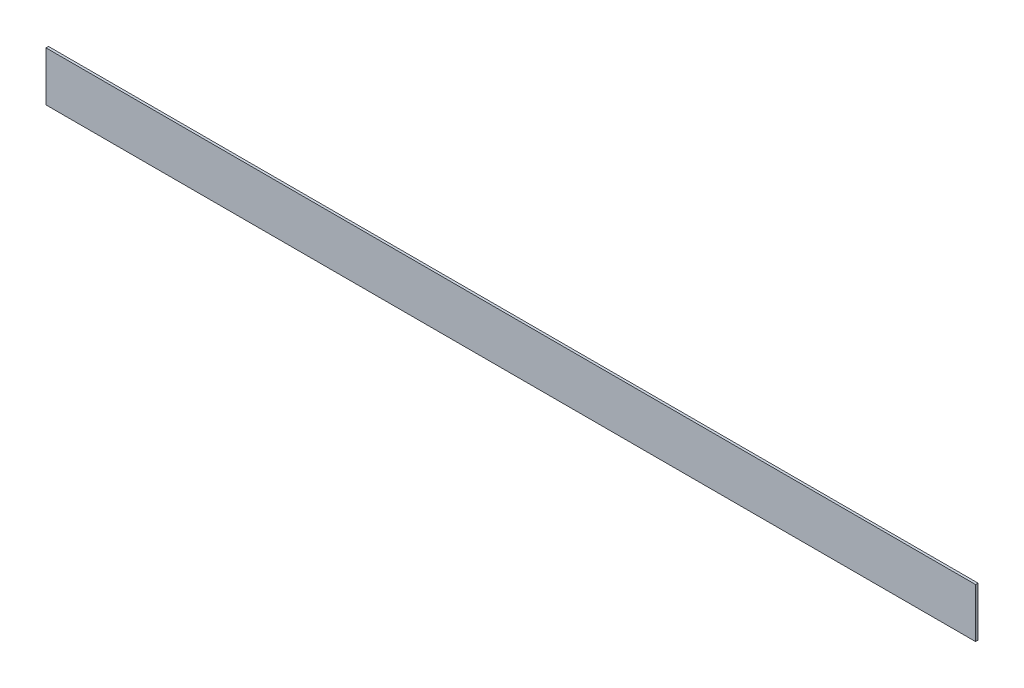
ISO-10303-21;
HEADER;
FILE_DESCRIPTION(('STEP AP214'),'2;1');
FILE_NAME('part.step','',(''),(''),'','','');
FILE_SCHEMA(('AUTOMOTIVE_DESIGN { 1 0 10303 214 1 1 1 1 }'));
ENDSEC;
DATA;
#1=APPLICATION_CONTEXT('core data for automotive mechanical design processes');
#2=APPLICATION_PROTOCOL_DEFINITION('international standard','automotive_design',2000,#1);
#3=PRODUCT_CONTEXT('',#1,'mechanical');
#4=PRODUCT('Part','Part','',(#3));
#5=PRODUCT_RELATED_PRODUCT_CATEGORY('part','',(#4));
#6=PRODUCT_DEFINITION_FORMATION('','',#4);
#7=PRODUCT_DEFINITION_CONTEXT('part definition',#1,'design');
#8=PRODUCT_DEFINITION('design','',#6,#7);
#9=PRODUCT_DEFINITION_SHAPE('','',#8);
#10=(LENGTH_UNIT() NAMED_UNIT(*) SI_UNIT(.MILLI.,.METRE.));
#11=(NAMED_UNIT(*) PLANE_ANGLE_UNIT() SI_UNIT($,.RADIAN.));
#12=(NAMED_UNIT(*) SI_UNIT($,.STERADIAN.) SOLID_ANGLE_UNIT());
#13=UNCERTAINTY_MEASURE_WITH_UNIT(LENGTH_MEASURE(1.E-05),#10,'distance_accuracy_value','');
#14=(GEOMETRIC_REPRESENTATION_CONTEXT(3) GLOBAL_UNCERTAINTY_ASSIGNED_CONTEXT((#13)) GLOBAL_UNIT_ASSIGNED_CONTEXT((#10,
#11,#12)) REPRESENTATION_CONTEXT('',''));
#15=CARTESIAN_POINT('',(0.,0.,0.));
#16=DIRECTION('',(0.,0.,1.));
#17=DIRECTION('',(1.,0.,0.));
#18=AXIS2_PLACEMENT_3D('',#15,#16,#17);
#19=CARTESIAN_POINT('',(0.,0.,6.35));
#20=DIRECTION('',(1.,0.,0.));
#21=DIRECTION('',(0.,0.,-1.));
#22=AXIS2_PLACEMENT_3D('',#19,#20,#21);
#23=PLANE('',#22);
#24=DIRECTION('',(0.,-1.,0.));
#25=VECTOR('',#24,1.);
#26=CARTESIAN_POINT('',(0.,0.,0.));
#27=LINE('',#26,#25);
#28=CARTESIAN_POINT('',(0.,127.,0.));
#29=VERTEX_POINT('',#28);
#30=CARTESIAN_POINT('',(0.,0.,0.));
#31=VERTEX_POINT('',#30);
#32=EDGE_CURVE('E102',#29,#31,#27,.T.);
#33=ORIENTED_EDGE('',*,*,#32,.T.);
#34=DIRECTION('',(0.,0.,-1.));
#35=VECTOR('',#34,1.);
#36=CARTESIAN_POINT('',(0.,0.,6.35));
#37=LINE('',#36,#35);
#38=CARTESIAN_POINT('',(0.,0.,6.35));
#39=VERTEX_POINT('',#38);
#40=EDGE_CURVE('E11',#39,#31,#37,.T.);
#41=ORIENTED_EDGE('',*,*,#40,.F.);
#42=DIRECTION('',(0.,-1.,0.));
#43=VECTOR('',#42,1.);
#44=CARTESIAN_POINT('',(0.,0.,6.35));
#45=LINE('',#44,#43);
#46=CARTESIAN_POINT('',(0.,127.,6.35));
#47=VERTEX_POINT('',#46);
#48=EDGE_CURVE('E90',#47,#39,#45,.T.);
#49=ORIENTED_EDGE('',*,*,#48,.F.);
#50=DIRECTION('',(0.,0.,-1.));
#51=VECTOR('',#50,1.);
#52=CARTESIAN_POINT('',(0.,127.,6.35));
#53=LINE('',#52,#51);
#54=EDGE_CURVE('E98',#47,#29,#53,.T.);
#55=ORIENTED_EDGE('',*,*,#54,.T.);
#56=EDGE_LOOP('',(#33,#41,#49,#55));
#57=FACE_BOUND('',#56,.T.);
#58=ADVANCED_FACE('F39',(#57),#23,.F.);
#59=CARTESIAN_POINT('',(0.,0.,6.35));
#60=DIRECTION('',(0.,1.,0.));
#61=DIRECTION('',(0.,0.,1.));
#62=AXIS2_PLACEMENT_3D('',#59,#60,#61);
#63=PLANE('',#62);
#64=DIRECTION('',(1.,0.,0.));
#65=VECTOR('',#64,1.);
#66=CARTESIAN_POINT('',(0.,0.,0.));
#67=LINE('',#66,#65);
#68=CARTESIAN_POINT('',(2387.6,0.,0.));
#69=VERTEX_POINT('',#68);
#70=EDGE_CURVE('E94',#31,#69,#67,.T.);
#71=ORIENTED_EDGE('',*,*,#70,.T.);
#72=DIRECTION('',(0.,0.,-1.));
#73=VECTOR('',#72,1.);
#74=CARTESIAN_POINT('',(2387.6,0.,6.35));
#75=LINE('',#74,#73);
#76=CARTESIAN_POINT('',(2387.6,0.,6.35));
#77=VERTEX_POINT('',#76);
#78=EDGE_CURVE('E47',#77,#69,#75,.T.);
#79=ORIENTED_EDGE('',*,*,#78,.F.);
#80=DIRECTION('',(1.,0.,0.));
#81=VECTOR('',#80,1.);
#82=CARTESIAN_POINT('',(0.,0.,6.35));
#83=LINE('',#82,#81);
#84=EDGE_CURVE('E85',#39,#77,#83,.T.);
#85=ORIENTED_EDGE('',*,*,#84,.F.);
#86=ORIENTED_EDGE('',*,*,#40,.T.);
#87=EDGE_LOOP('',(#71,#79,#85,#86));
#88=FACE_BOUND('',#87,.T.);
#89=ADVANCED_FACE('F93',(#88),#63,.F.);
#90=CARTESIAN_POINT('',(2387.6,0.,6.35));
#91=DIRECTION('',(-1.,0.,0.));
#92=DIRECTION('',(0.,0.,1.));
#93=AXIS2_PLACEMENT_3D('',#90,#91,#92);
#94=PLANE('',#93);
#95=DIRECTION('',(0.,1.,0.));
#96=VECTOR('',#95,1.);
#97=CARTESIAN_POINT('',(2387.6,0.,0.));
#98=LINE('',#97,#96);
#99=CARTESIAN_POINT('',(2387.6,127.,0.));
#100=VERTEX_POINT('',#99);
#101=EDGE_CURVE('E72',#69,#100,#98,.T.);
#102=ORIENTED_EDGE('',*,*,#101,.T.);
#103=DIRECTION('',(0.,0.,-1.));
#104=VECTOR('',#103,1.);
#105=CARTESIAN_POINT('',(2387.6,127.,6.35));
#106=LINE('',#105,#104);
#107=CARTESIAN_POINT('',(2387.6,127.,6.35));
#108=VERTEX_POINT('',#107);
#109=EDGE_CURVE('E95',#108,#100,#106,.T.);
#110=ORIENTED_EDGE('',*,*,#109,.F.);
#111=DIRECTION('',(0.,1.,0.));
#112=VECTOR('',#111,1.);
#113=CARTESIAN_POINT('',(2387.6,0.,6.35));
#114=LINE('',#113,#112);
#115=EDGE_CURVE('E88',#77,#108,#114,.T.);
#116=ORIENTED_EDGE('',*,*,#115,.F.);
#117=ORIENTED_EDGE('',*,*,#78,.T.);
#118=EDGE_LOOP('',(#102,#110,#116,#117));
#119=FACE_BOUND('',#118,.T.);
#120=ADVANCED_FACE('F96',(#119),#94,.F.);
#121=CARTESIAN_POINT('',(0.,127.,6.35));
#122=DIRECTION('',(0.,-1.,0.));
#123=DIRECTION('',(0.,0.,-1.));
#124=AXIS2_PLACEMENT_3D('',#121,#122,#123);
#125=PLANE('',#124);
#126=DIRECTION('',(-1.,0.,0.));
#127=VECTOR('',#126,1.);
#128=CARTESIAN_POINT('',(0.,127.,0.));
#129=LINE('',#128,#127);
#130=EDGE_CURVE('E78',#100,#29,#129,.T.);
#131=ORIENTED_EDGE('',*,*,#130,.T.);
#132=ORIENTED_EDGE('',*,*,#54,.F.);
#133=DIRECTION('',(-1.,0.,0.));
#134=VECTOR('',#133,1.);
#135=CARTESIAN_POINT('',(0.,127.,6.35));
#136=LINE('',#135,#134);
#137=EDGE_CURVE('E55',#108,#47,#136,.T.);
#138=ORIENTED_EDGE('',*,*,#137,.F.);
#139=ORIENTED_EDGE('',*,*,#109,.T.);
#140=EDGE_LOOP('',(#131,#132,#138,#139));
#141=FACE_BOUND('',#140,.T.);
#142=ADVANCED_FACE('F109',(#141),#125,.F.);
#143=CARTESIAN_POINT('',(0.,0.,6.35));
#144=DIRECTION('',(0.,0.,-1.));
#145=DIRECTION('',(-1.,0.,0.));
#146=AXIS2_PLACEMENT_3D('',#143,#144,#145);
#147=PLANE('',#146);
#148=ORIENTED_EDGE('',*,*,#48,.T.);
#149=ORIENTED_EDGE('',*,*,#84,.T.);
#150=ORIENTED_EDGE('',*,*,#115,.T.);
#151=ORIENTED_EDGE('',*,*,#137,.T.);
#152=EDGE_LOOP('',(#148,#149,#150,#151));
#153=FACE_BOUND('',#152,.T.);
#154=ADVANCED_FACE('F86',(#153),#147,.F.);
#155=CARTESIAN_POINT('',(0.,0.,0.));
#156=DIRECTION('',(0.,0.,-1.));
#157=DIRECTION('',(-1.,0.,0.));
#158=AXIS2_PLACEMENT_3D('',#155,#156,#157);
#159=PLANE('',#158);
#160=ORIENTED_EDGE('',*,*,#32,.F.);
#161=ORIENTED_EDGE('',*,*,#130,.F.);
#162=ORIENTED_EDGE('',*,*,#101,.F.);
#163=ORIENTED_EDGE('',*,*,#70,.F.);
#164=EDGE_LOOP('',(#160,#161,#162,#163));
#165=FACE_BOUND('',#164,.T.);
#166=ADVANCED_FACE('F112',(#165),#159,.T.);
#167=CLOSED_SHELL('',(#58,#89,#120,#142,#154,#166));
#168=MANIFOLD_SOLID_BREP('B2',#167);
#169=ADVANCED_BREP_SHAPE_REPRESENTATION('',(#18,#168),#14);
#170=SHAPE_DEFINITION_REPRESENTATION(#9,#169);
ENDSEC;
END-ISO-10303-21;
